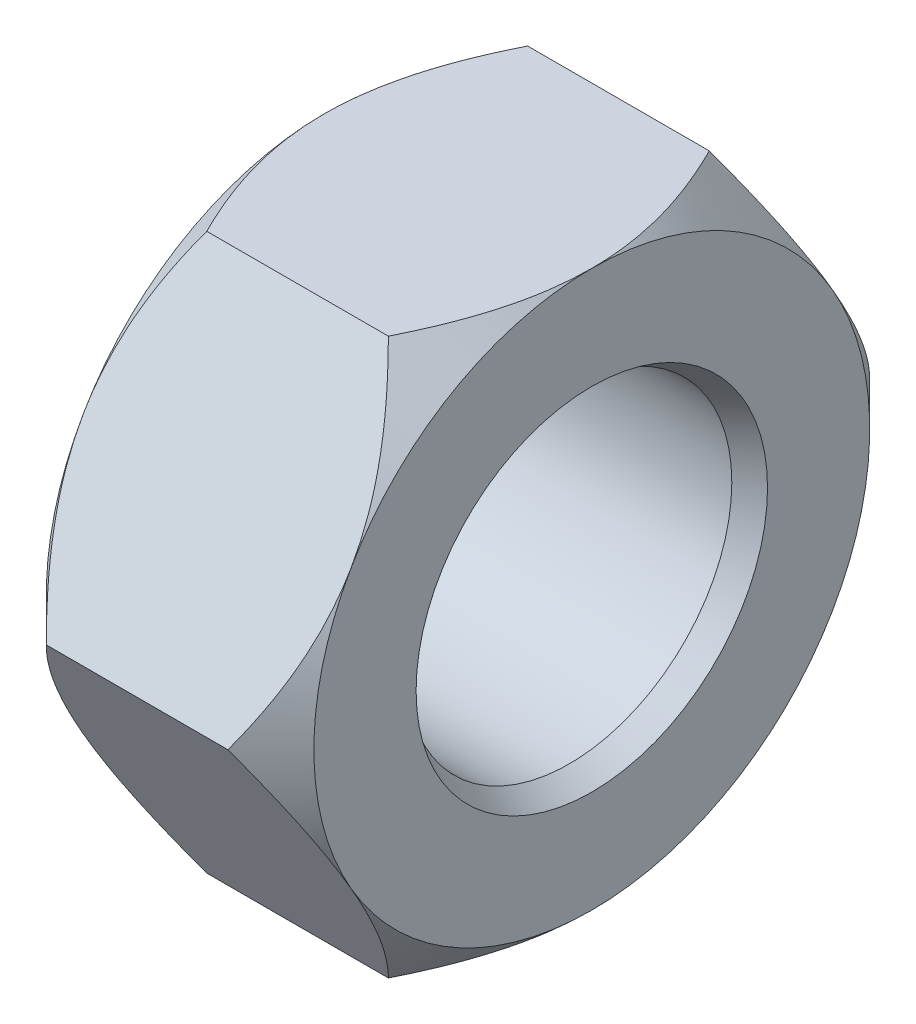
from build123d import *
from OCP.BRepFilletAPI import BRepFilletAPI_MakeChamfer

# Parameters (mm, degrees)
ESQUISSE2_OUTSIDE_W    = 49.784
ESQUISSE2_OUTSIDE_H    = 49.784
PROFIL_HEXAGONAL_DEPTH = 30.214722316
CHANFREIN1_SIZE        = 1.1
CHANFREIN1_SIZE2       = 0.635085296


with BuildPart() as part:
    # Esquisse1 → Volume (revolve)
    with BuildSketch(Plane.XY, mode=Mode.PRIVATE) as volume_sk:
        Polygon((0, 13.5), (0, 7.9), (13, 7.9), (13, 13.5), (8, 18.5), (5, 18.5), align=None)
    revolve(volume_sk.sketch.rotate(Axis((-26.703631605, 0, 0), (1, 0, 0)), 90), axis=Axis((-26.703631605, 0, 0), (1, 0, 0)))

    # Esquisse2 outside → Profil hexagonal (cut, through all)
    with BuildSketch(Plane.ZY):
        Rectangle(ESQUISSE2_OUTSIDE_W, ESQUISSE2_OUTSIDE_H)
        Polygon((7.794228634, -13.5), (15.588457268, 0), (7.794228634, 13.5), (-7.794228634, 13.5), (-15.588457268, 0), (-7.794228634, -13.5), align=None, mode=Mode.SUBTRACT)
    extrude(amount=-PROFIL_HEXAGONAL_DEPTH, mode=Mode.SUBTRACT)

    # Chanfrein1: one chamfer whose edges measure the first distance from different faces: ONE call of the kernel's chamfer builder (chamfer() names one face for all edges)
    chanfrein1_edges_1 = [part.edges().sort_by_distance(p)[0] for p in [
        (0, 0, -7.9),
    ]]
    chanfrein1_side_1 = [part.faces().sort_by_distance(p)[0] for p in [
        (0, -5e-09, 13.118162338),
    ]]
    chanfrein1_edges_2 = [part.edges().sort_by_distance(p)[0] for p in [
        (13, 0, -7.9),
    ]]
    chanfrein1_side_2 = [part.faces().sort_by_distance(p)[0] for p in [
        (6.5, 0, -7.9),
    ]]
    chanfrein1 = BRepFilletAPI_MakeChamfer(part.part.solid().wrapped)
    for e in chanfrein1_edges_1:
        chanfrein1.Add(CHANFREIN1_SIZE, CHANFREIN1_SIZE2, e.wrapped, chanfrein1_side_1[0].wrapped)  # the first distance lies on this face
    for e in chanfrein1_edges_2:
        chanfrein1.Add(CHANFREIN1_SIZE, CHANFREIN1_SIZE2, e.wrapped, chanfrein1_side_2[0].wrapped)  # the first distance lies on this face
    add(Compound.cast(chanfrein1.Shape()), mode=Mode.REPLACE)


solid = part.part
